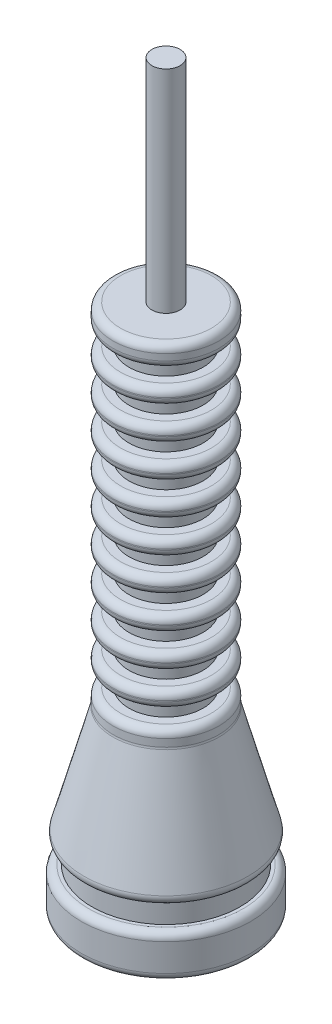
from build123d import *

# Parameters (mm, degrees)
FILLET1_R           = 0.7
SKETCH5_R           = 1.331384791
BOSS_EXTRUDE2_DEPTH = 10


with BuildPart() as part:
    # Sketch1 → Revolve1 (revolve)
    with BuildSketch(Plane.XY, mode=Mode.PRIVATE) as revolve1_sk:
        Polygon((0, 0), (0, 50), (0, 60), (1.331384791, 60), (1.331384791, 50), (5, 50), (5, 48), (3.5, 48), (3.5, 46.4), (5, 46.399999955), (5, 44.899999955), (3.5, 44.899999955), (3.5, 43.299999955), (5, 43.29999991), (5, 41.79999991), (3.5, 41.79999991), (3.5, 40.19999991), (5, 40.199999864), (5, 38.699999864), (3.5, 38.699999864), (3.5, 37.099999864), (5, 37.099999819), (5, 35.599999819), (3.5, 35.599999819), (3.5, 33.999999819), (5, 33.999999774), (5, 32.499999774), (3.5, 32.499999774), (3.5, 30.899999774), (5, 30.899999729), (5, 29.399999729), (3.5, 29.399999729), (3.5, 27.799999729), (5, 27.799999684), (5, 26.299999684), (3.5, 26.299999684), (3.5, 24.699999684), (5, 24.699999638), (5, 23.199999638), (3.5, 23.199999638), (3.5, 21.599999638), (5, 21.599999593), (5, 20.099999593), (3.5, 20.099999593), (3.5, 18.499999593), (5, 18.499999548), (5, 16.999999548), (8, 6), (7, 6), (7, 4), (8, 4), (8, 0), align=None)
    revolve(revolve1_sk.sketch.rotate(Axis((0, 0, 0), (0, 1, 0)), 90), axis=Axis((0, 0, 0), (0, 1, 0)))

    # Fillet1
    fillet1_edges = [part.edges().sort_by_distance(p)[0] for p in [
        (0, 50, 5),
        (0, 48, 5),
        (0, 46.399999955, 5),
        (0, 44.899999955, 5),
        (0, 43.29999991, 5),
        (0, 41.79999991, 5),
        (0, 40.199999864, 5),
        (0, 38.699999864, 5),
        (0, 37.099999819, 5),
        (0, 35.599999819, 5),
        (0, 33.999999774, 5),
        (0, 32.499999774, 5),
        (0, 30.899999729, 5),
        (0, 29.399999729, 5),
        (0, 27.799999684, 5),
        (0, 26.299999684, 5),
        (0, 24.699999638, 5),
        (0, 23.199999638, 5),
        (0, 21.599999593, 5),
        (0, 20.099999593, 5),
        (0, 18.499999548, 5),
        (0, 16.999999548, 5),
        (0, 6, 8),
        (0, 4, 8),
        (0, 0, 8),
    ]]
    fillet(fillet1_edges, radius=FILLET1_R)

    # Sketch5 → Boss-Extrude2 (add)
    with BuildSketch(Plane(origin=(0, 60, 0), x_dir=(1, 0, 0), z_dir=(0, 1, 0))):
        with Locations(Location((0, 0, 0), (0, 0, 90))):
            Circle(SKETCH5_R)
    extrude(amount=BOSS_EXTRUDE2_DEPTH)


solid = part.part
